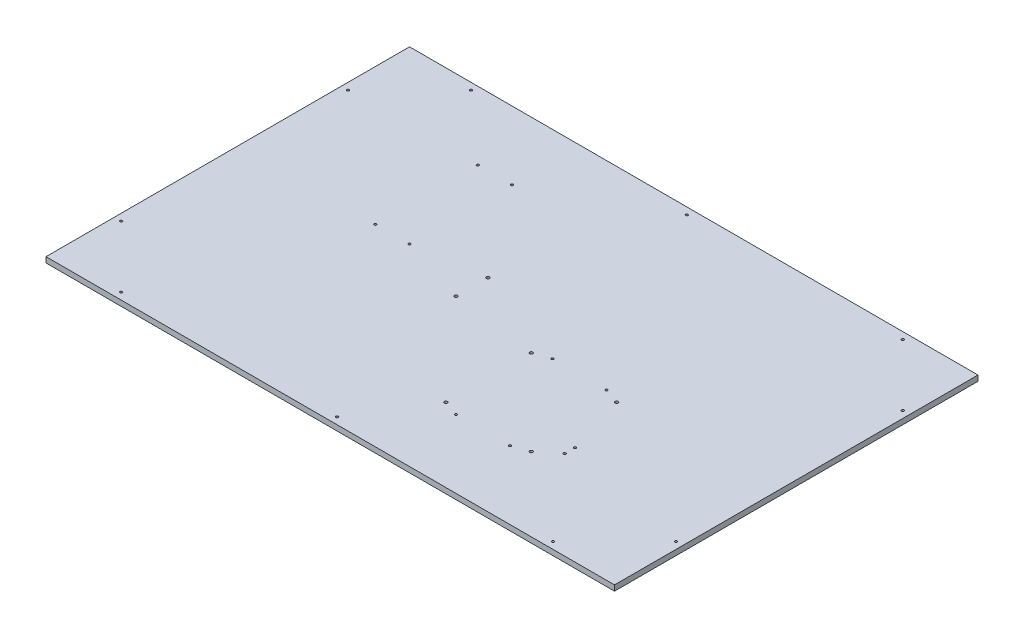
from build123d import *

# Parameters (mm, degrees)
SKIZZE1_W                        = 832
SKIZZE1_H                        = 532
AUFSATZ_LINEAR_AUSTRAGEN1_DEPTH  = 8
F_3_5_3_5_DURCHMESSER_BOHRUNG1_D = 3.5
F_4_5_4_5_DURCHMESSER_BOHRUNG1_D = 4.5
F_3_5_3_5_DURCHMESSER_BOHRUNG2_D = 3.5
F_3_5_3_5_DURCHMESSER_BOHRUNG3_D = 3.5
FASE1_SIZE                       = 1.5
FASE2_SIZE                       = 2.5


with BuildPart() as part:
    # Skizze1 → Aufsatz-Linear austragen1 (new body)
    with BuildSketch(Plane(origin=(0, 0, 0), x_dir=(1, 0, 0), z_dir=(0, 1, 0))):
        Rectangle(SKIZZE1_W, SKIZZE1_H)
    extrude(amount=AUFSATZ_LINEAR_AUSTRAGEN1_DEPTH)

    # 3.5 _3.5_ Durchmesser Bohrung1 (through all)
    with Locations(Plane(origin=(0, 8, 0), x_dir=(1, 0, 0), z_dir=(0, 1, 0))):
        with Locations((-216, 166), (-166, 166), (-166, 16), (-216, 16), (84, -24.8), (163.1, -24.8), (163.1, -166), (84, -166)):
            Hole(F_3_5_3_5_DURCHMESSER_BOHRUNG1_D / 2)

    # 4.5 _4.5_ Durchmesser Bohrung1 (through all)
    with Locations(Plane(origin=(0, 8, 0), x_dir=(1, 0, 0), z_dir=(0, 1, 0))):
        with Locations((61.05, -32.9), (186.05, -32.9), (186.05, -157.9), (61.05, -157.9), (-66, 30.75), (-66, -16)):
            Hole(F_4_5_4_5_DURCHMESSER_BOHRUNG1_D / 2)

    # 3.5 _3.5_ Durchmesser Bohrung2 (through all)
    with Locations(Plane(origin=(0, 8, 0), x_dir=(1, 0, 0), z_dir=(0, 1, 0))):
        with Locations((213.1, -136), (213.1, -121)):
            Hole(F_3_5_3_5_DURCHMESSER_BOHRUNG2_D / 2)

    # 3.5 _3.5_ Durchmesser Bohrung3 (through all)
    with Locations(Plane(origin=(0, 8, 0), x_dir=(1, 0, 0), z_dir=(0, 1, 0))):
        with Locations((-406, 166), (-406, -166), (-316, -256), (0, -256), (316, -256), (406, -166), (406, 166), (316, 256), (0, 256), (-316, 256)):
            Hole(F_3_5_3_5_DURCHMESSER_BOHRUNG3_D / 2)

    # Fase1
    fase1_edges = [part.edges().sort_by_distance(p)[0] for p in [
        (214.85, 0, 136),
        (-314.25, 0, -256),
        (1.75, 0, -256),
        (317.75, 0, -256),
        (407.75, 0, -166),
        (407.75, 0, 166),
        (317.75, 0, 256),
        (1.75, 0, 256),
        (-314.25, 0, 256),
        (-404.25, 0, 166),
        (-404.25, 0, -166),
        (85.75, 0, 166),
        (164.85, 0, 166),
        (164.85, 0, 24.8),
        (85.75, 0, 24.8),
        (-214.25, 0, -16),
        (-164.25, 0, -16),
        (-164.25, 0, -166),
        (-214.25, 0, -166),
        (214.85, 0, 121),
    ]]
    chamfer(fase1_edges, length=FASE1_SIZE)

    # Fase2
    fase2_edges = [part.edges().sort_by_distance(p)[0] for p in [
        (-63.75, 0, 16),
        (-63.75, 0, -30.75),
        (63.3, 0, 157.9),
        (188.3, 0, 157.9),
        (188.3, 0, 32.9),
        (63.3, 0, 32.9),
    ]]
    chamfer(fase2_edges, length=FASE2_SIZE)


solid = part.part
